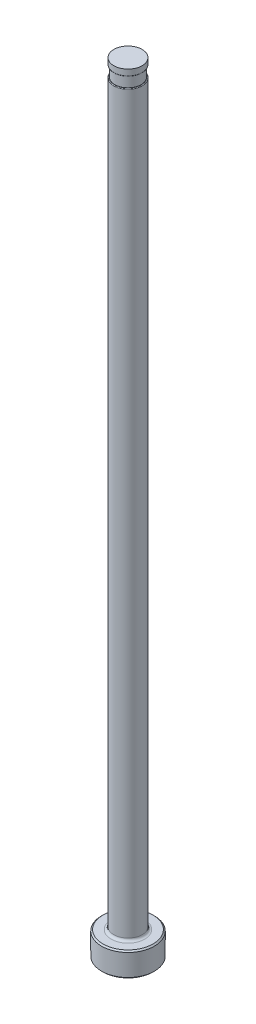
ISO-10303-21;
HEADER;
FILE_DESCRIPTION(('STEP AP214'),'2;1');
FILE_NAME('part.step','',(''),(''),'','','');
FILE_SCHEMA(('AUTOMOTIVE_DESIGN { 1 0 10303 214 1 1 1 1 }'));
ENDSEC;
DATA;
#1=APPLICATION_CONTEXT('core data for automotive mechanical design processes');
#2=APPLICATION_PROTOCOL_DEFINITION('international standard','automotive_design',2000,#1);
#3=PRODUCT_CONTEXT('',#1,'mechanical');
#4=PRODUCT('Part','Part','',(#3));
#5=PRODUCT_RELATED_PRODUCT_CATEGORY('part','',(#4));
#6=PRODUCT_DEFINITION_FORMATION('','',#4);
#7=PRODUCT_DEFINITION_CONTEXT('part definition',#1,'design');
#8=PRODUCT_DEFINITION('design','',#6,#7);
#9=PRODUCT_DEFINITION_SHAPE('','',#8);
#10=(LENGTH_UNIT() NAMED_UNIT(*) SI_UNIT(.MILLI.,.METRE.));
#11=(NAMED_UNIT(*) PLANE_ANGLE_UNIT() SI_UNIT($,.RADIAN.));
#12=(NAMED_UNIT(*) SI_UNIT($,.STERADIAN.) SOLID_ANGLE_UNIT());
#13=UNCERTAINTY_MEASURE_WITH_UNIT(LENGTH_MEASURE(1.E-05),#10,'distance_accuracy_value','');
#14=(GEOMETRIC_REPRESENTATION_CONTEXT(3) GLOBAL_UNCERTAINTY_ASSIGNED_CONTEXT((#13)) GLOBAL_UNIT_ASSIGNED_CONTEXT((#10,
#11,#12)) REPRESENTATION_CONTEXT('',''));
#15=CARTESIAN_POINT('',(0.,0.,0.));
#16=DIRECTION('',(0.,0.,1.));
#17=DIRECTION('',(1.,0.,0.));
#18=AXIS2_PLACEMENT_3D('',#15,#16,#17);
#19=CARTESIAN_POINT('',(-2.77748999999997,151.13,0.));
#20=DIRECTION('',(0.,1.,0.));
#21=DIRECTION('',(0.,0.,1.));
#22=AXIS2_PLACEMENT_3D('',#19,#20,#21);
#23=PLANE('',#22);
#24=CARTESIAN_POINT('',(0.,151.13,0.));
#25=DIRECTION('',(0.,1.,0.));
#26=DIRECTION('',(0.,0.,1.));
#27=AXIS2_PLACEMENT_3D('',#24,#25,#26);
#28=CIRCLE('',#27,2.63778999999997);
#29=CARTESIAN_POINT('',(0.,151.13,2.63778999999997));
#30=VERTEX_POINT('',#29);
#31=EDGE_CURVE('E11',#30,#30,#28,.F.);
#32=ORIENTED_EDGE('',*,*,#31,.T.);
#33=EDGE_LOOP('',(#32));
#34=FACE_BOUND('',#33,.T.);
#35=CARTESIAN_POINT('',(0.,151.13,0.));
#36=DIRECTION('',(0.,1.,0.));
#37=DIRECTION('',(0.,0.,1.));
#38=AXIS2_PLACEMENT_3D('',#35,#36,#37);
#39=CIRCLE('',#38,2.57428999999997);
#40=CARTESIAN_POINT('',(0.,151.13,2.57428999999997));
#41=VERTEX_POINT('',#40);
#42=EDGE_CURVE('E78',#41,#41,#39,.T.);
#43=ORIENTED_EDGE('',*,*,#42,.T.);
#44=EDGE_LOOP('',(#43));
#45=FACE_BOUND('',#44,.T.);
#46=ADVANCED_FACE('F36',(#34,#45),#23,.F.);
#47=CARTESIAN_POINT('',(0.,259.958771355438,0.));
#48=DIRECTION('',(0.,1.,0.));
#49=DIRECTION('',(0.,0.,1.));
#50=AXIS2_PLACEMENT_3D('',#47,#48,#49);
#51=CYLINDRICAL_SURFACE('',#50,2.77748999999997);
#52=DIRECTION('',(0.,1.,0.));
#53=VECTOR('',#52,1.);
#54=CARTESIAN_POINT('',(-2.57428999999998,259.958771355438,-1.04282390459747));
#55=LINE('',#54,#53);
#56=CARTESIAN_POINT('',(-2.57428999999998,148.971,-1.04282390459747));
#57=VERTEX_POINT('',#56);
#58=CARTESIAN_POINT('',(-2.57428999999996,86.614,-1.04282390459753));
#59=VERTEX_POINT('',#58);
#60=EDGE_CURVE('E73',#57,#59,#55,.F.);
#61=ORIENTED_EDGE('',*,*,#60,.F.);
#62=CARTESIAN_POINT('',(0.,148.971,0.));
#63=DIRECTION('',(0.,-1.,0.));
#64=DIRECTION('',(0.,0.,-1.));
#65=AXIS2_PLACEMENT_3D('',#62,#63,#64);
#66=CIRCLE('',#65,2.77748999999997);
#67=CARTESIAN_POINT('',(-2.57428999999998,148.971,1.04282390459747));
#68=VERTEX_POINT('',#67);
#69=EDGE_CURVE('E51',#57,#68,#66,.T.);
#70=ORIENTED_EDGE('',*,*,#69,.T.);
#71=DIRECTION('',(0.,1.,0.));
#72=VECTOR('',#71,1.);
#73=CARTESIAN_POINT('',(-2.57428999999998,259.958771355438,1.04282390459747));
#74=LINE('',#73,#72);
#75=CARTESIAN_POINT('',(-2.57428999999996,86.614,1.04282390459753));
#76=VERTEX_POINT('',#75);
#77=EDGE_CURVE('E84',#76,#68,#74,.T.);
#78=ORIENTED_EDGE('',*,*,#77,.F.);
#79=CARTESIAN_POINT('',(-2.57428999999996,86.614,-1.04282390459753));
#80=CARTESIAN_POINT('',(-2.57428787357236,86.5815852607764,-1.04282111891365));
#81=CARTESIAN_POINT('',(-2.57478701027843,86.5491850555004,-1.04159798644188));
#82=CARTESIAN_POINT('',(-2.57676382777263,86.4845964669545,-1.03670102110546));
#83=CARTESIAN_POINT('',(-2.57824163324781,86.4524081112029,-1.03302687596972));
#84=CARTESIAN_POINT('',(-2.58411032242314,86.356391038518,-1.01830472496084));
#85=CARTESIAN_POINT('',(-2.58993639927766,86.2931681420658,-1.00355696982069));
#86=CARTESIAN_POINT('',(-2.60484835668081,86.1701975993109,-0.964186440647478));
#87=CARTESIAN_POINT('',(-2.61393879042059,86.1104549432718,-0.939549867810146));
#88=CARTESIAN_POINT('',(-2.63439257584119,85.9964330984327,-0.880565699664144));
#89=CARTESIAN_POINT('',(-2.64575368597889,85.9421486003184,-0.846227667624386));
#90=CARTESIAN_POINT('',(-2.66906948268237,85.8423648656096,-0.769463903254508));
#91=CARTESIAN_POINT('',(-2.68099701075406,85.796654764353,-0.727304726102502));
#92=CARTESIAN_POINT('',(-2.70429977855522,85.7137106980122,-0.635186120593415));
#93=CARTESIAN_POINT('',(-2.71567511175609,85.676475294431,-0.585228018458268));
#94=CARTESIAN_POINT('',(-2.73569711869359,85.6140565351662,-0.482647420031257));
#95=CARTESIAN_POINT('',(-2.74447837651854,85.5882160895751,-0.430450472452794));
#96=CARTESIAN_POINT('',(-2.75929586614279,85.5457915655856,-0.322059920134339));
#97=CARTESIAN_POINT('',(-2.76533294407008,85.5292046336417,-0.265867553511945));
#98=CARTESIAN_POINT('',(-2.77376309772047,85.5062965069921,-0.153923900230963));
#99=CARTESIAN_POINT('',(-2.77631330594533,85.4995317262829,-0.0982747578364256));
#100=CARTESIAN_POINT('',(-2.77801884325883,85.4949917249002,0.0134385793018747));
#101=CARTESIAN_POINT('',(-2.77717458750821,85.497215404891,0.0695027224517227));
#102=CARTESIAN_POINT('',(-2.7722209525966,85.5104908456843,0.179520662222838));
#103=CARTESIAN_POINT('',(-2.76816343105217,85.5214024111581,0.233493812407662));
#104=CARTESIAN_POINT('',(-2.75726458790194,85.5516137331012,0.33873691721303));
#105=CARTESIAN_POINT('',(-2.7504233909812,85.5709131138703,0.390006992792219));
#106=CARTESIAN_POINT('',(-2.73459621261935,85.617579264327,0.488834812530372));
#107=CARTESIAN_POINT('',(-2.7255949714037,85.6450037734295,0.536362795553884));
#108=CARTESIAN_POINT('',(-2.70638807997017,85.7071227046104,0.626118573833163));
#109=CARTESIAN_POINT('',(-2.69618232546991,85.741817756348,0.668345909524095));
#110=CARTESIAN_POINT('',(-2.67522940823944,85.8187559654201,0.747895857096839));
#111=CARTESIAN_POINT('',(-2.66447542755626,85.8612077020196,0.785014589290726));
#112=CARTESIAN_POINT('',(-2.64380227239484,85.9516395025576,0.852053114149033));
#113=CARTESIAN_POINT('',(-2.63388340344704,85.9996215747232,0.881970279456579));
#114=CARTESIAN_POINT('',(-2.61524736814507,86.1028148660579,0.935839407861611));
#115=CARTESIAN_POINT('',(-2.60663744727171,86.1582867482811,0.959328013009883));
#116=CARTESIAN_POINT('',(-2.5921893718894,86.2724618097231,0.997711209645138));
#117=CARTESIAN_POINT('',(-2.58635078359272,86.3311644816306,1.01260714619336));
#118=CARTESIAN_POINT('',(-2.57955503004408,86.4275266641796,1.02975451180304));
#119=CARTESIAN_POINT('',(-2.57758531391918,86.4646676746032,1.03466198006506));
#120=CARTESIAN_POINT('',(-2.57495138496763,86.5392020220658,1.04119168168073));
#121=CARTESIAN_POINT('',(-2.57428434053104,86.5765946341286,1.04282104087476));
#122=CARTESIAN_POINT('',(-2.57428999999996,86.614,1.04282390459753));
#123=B_SPLINE_CURVE_WITH_KNOTS('',3,(#79,#80,#81,#82,#83,#84,#85,#86,#87,#88,#89,#90,#91,#92,
#93,#94,#95,#96,#97,#98,#99,#100,#101,#102,#103,#104,#105,#106,#107,#108,#109,#110,#111,#112,
#113,#114,#115,#116,#117,#118,#119,#120,#121,#122),.UNSPECIFIED.,.F.,.F.,(4,2,2,2,2,2,2,2,2,2,2,
2,2,2,2,2,2,2,2,2,2,4),(0.,0.0971880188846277,0.194388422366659,0.388960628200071,
0.583805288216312,0.778458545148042,0.967406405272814,1.1563221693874,1.33212671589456,
1.50787701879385,1.67541271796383,1.84292792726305,2.00779344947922,2.17265158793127,
2.33871056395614,2.5047839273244,2.67625192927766,2.84778239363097,3.02956415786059,
3.21131745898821,3.32371085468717,3.43585966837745),.UNSPECIFIED.);
#124=EDGE_CURVE('E81',#59,#76,#123,.T.);
#125=ORIENTED_EDGE('',*,*,#124,.F.);
#126=EDGE_LOOP('',(#61,#70,#78,#125));
#127=FACE_BOUND('',#126,.T.);
#128=CARTESIAN_POINT('',(0.,5.25779999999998,0.));
#129=DIRECTION('',(0.,1.,0.));
#130=DIRECTION('',(0.,0.,1.));
#131=AXIS2_PLACEMENT_3D('',#128,#129,#130);
#132=CIRCLE('',#131,2.77748999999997);
#133=CARTESIAN_POINT('',(0.,5.25779999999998,2.77748999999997));
#134=VERTEX_POINT('',#133);
#135=EDGE_CURVE('E116',#134,#134,#132,.T.);
#136=ORIENTED_EDGE('',*,*,#135,.T.);
#137=EDGE_LOOP('',(#136));
#138=FACE_BOUND('',#137,.T.);
#139=ADVANCED_FACE('F82',(#127,#138),#51,.T.);
#140=CARTESIAN_POINT('',(0.,0.,0.));
#141=DIRECTION('',(0.,-1.,0.));
#142=DIRECTION('',(0.,0.,-1.));
#143=AXIS2_PLACEMENT_3D('',#140,#141,#142);
#144=PLANE('',#143);
#145=CARTESIAN_POINT('',(0.,0.,0.));
#146=DIRECTION('',(0.,-1.,0.));
#147=DIRECTION('',(0.,0.,-1.));
#148=AXIS2_PLACEMENT_3D('',#145,#146,#147);
#149=CIRCLE('',#148,4.90220000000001);
#150=CARTESIAN_POINT('',(0.,0.,-4.90220000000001));
#151=VERTEX_POINT('',#150);
#152=EDGE_CURVE('E113',#151,#151,#149,.T.);
#153=ORIENTED_EDGE('',*,*,#152,.T.);
#154=EDGE_LOOP('',(#153));
#155=FACE_BOUND('',#154,.T.);
#156=ADVANCED_FACE('F192',(#155),#144,.T.);
#157=CARTESIAN_POINT('',(0.,259.958771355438,0.));
#158=DIRECTION('',(0.,1.,0.));
#159=DIRECTION('',(0.,0.,1.));
#160=AXIS2_PLACEMENT_3D('',#157,#158,#159);
#161=CYLINDRICAL_SURFACE('',#160,5.15619999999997);
#162=CARTESIAN_POINT('',(0.,4.49580000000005,0.));
#163=DIRECTION('',(0.,1.,0.));
#164=DIRECTION('',(0.,0.,1.));
#165=AXIS2_PLACEMENT_3D('',#162,#163,#164);
#166=CIRCLE('',#165,5.15619999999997);
#167=CARTESIAN_POINT('',(0.,4.49580000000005,5.15619999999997));
#168=VERTEX_POINT('',#167);
#169=EDGE_CURVE('E110',#168,#168,#166,.F.);
#170=ORIENTED_EDGE('',*,*,#169,.T.);
#171=EDGE_LOOP('',(#170));
#172=FACE_BOUND('',#171,.T.);
#173=CARTESIAN_POINT('',(0.,0.253999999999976,0.));
#174=DIRECTION('',(0.,-1.,0.));
#175=DIRECTION('',(0.,0.,-1.));
#176=AXIS2_PLACEMENT_3D('',#173,#174,#175);
#177=CIRCLE('',#176,5.15619999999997);
#178=CARTESIAN_POINT('',(0.,0.253999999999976,-5.15619999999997));
#179=VERTEX_POINT('',#178);
#180=EDGE_CURVE('E107',#179,#179,#177,.F.);
#181=ORIENTED_EDGE('',*,*,#180,.T.);
#182=EDGE_LOOP('',(#181));
#183=FACE_BOUND('',#182,.T.);
#184=ADVANCED_FACE('F195',(#172,#183),#161,.T.);
#185=CARTESIAN_POINT('',(-5.15619999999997,4.7498,0.));
#186=DIRECTION('',(0.,1.,0.));
#187=DIRECTION('',(0.,0.,1.));
#188=AXIS2_PLACEMENT_3D('',#185,#186,#187);
#189=PLANE('',#188);
#190=CARTESIAN_POINT('',(0.,4.7498,0.));
#191=DIRECTION('',(0.,1.,0.));
#192=DIRECTION('',(0.,0.,1.));
#193=AXIS2_PLACEMENT_3D('',#190,#191,#192);
#194=CIRCLE('',#193,3.28548999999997);
#195=CARTESIAN_POINT('',(0.,4.7498,3.28548999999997));
#196=VERTEX_POINT('',#195);
#197=EDGE_CURVE('E87',#196,#196,#194,.F.);
#198=ORIENTED_EDGE('',*,*,#197,.T.);
#199=EDGE_LOOP('',(#198));
#200=FACE_BOUND('',#199,.T.);
#201=CARTESIAN_POINT('',(0.,4.7498,0.));
#202=DIRECTION('',(0.,1.,0.));
#203=DIRECTION('',(0.,0.,1.));
#204=AXIS2_PLACEMENT_3D('',#201,#202,#203);
#205=CIRCLE('',#204,4.90220000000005);
#206=CARTESIAN_POINT('',(0.,4.7498,4.90220000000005));
#207=VERTEX_POINT('',#206);
#208=EDGE_CURVE('E104',#207,#207,#205,.T.);
#209=ORIENTED_EDGE('',*,*,#208,.T.);
#210=EDGE_LOOP('',(#209));
#211=FACE_BOUND('',#210,.T.);
#212=ADVANCED_FACE('F190',(#200,#211),#189,.T.);
#213=CARTESIAN_POINT('',(0.,4.74980000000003,0.));
#214=DIRECTION('',(0.,-1.,0.));
#215=DIRECTION('',(0.,0.,-1.));
#216=AXIS2_PLACEMENT_3D('',#213,#214,#215);
#217=CONICAL_SURFACE('',#216,4.90220000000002,0.785398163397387);
#218=ORIENTED_EDGE('',*,*,#169,.F.);
#219=EDGE_LOOP('',(#218));
#220=FACE_BOUND('',#219,.T.);
#221=ORIENTED_EDGE('',*,*,#208,.F.);
#222=EDGE_LOOP('',(#221));
#223=FACE_BOUND('',#222,.T.);
#224=ADVANCED_FACE('F186',(#220,#223),#217,.T.);
#225=CARTESIAN_POINT('',(0.,0.253999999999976,0.));
#226=DIRECTION('',(0.,1.,0.));
#227=DIRECTION('',(0.,0.,1.));
#228=AXIS2_PLACEMENT_3D('',#225,#226,#227);
#229=CONICAL_SURFACE('',#228,5.15619999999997,0.785398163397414);
#230=ORIENTED_EDGE('',*,*,#152,.F.);
#231=EDGE_LOOP('',(#230));
#232=FACE_BOUND('',#231,.T.);
#233=ORIENTED_EDGE('',*,*,#180,.F.);
#234=EDGE_LOOP('',(#233));
#235=FACE_BOUND('',#234,.T.);
#236=ADVANCED_FACE('F182',(#232,#235),#229,.T.);
#237=CARTESIAN_POINT('',(0.,5.25779999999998,0.));
#238=DIRECTION('',(0.,1.,0.));
#239=DIRECTION('',(0.,0.,1.));
#240=AXIS2_PLACEMENT_3D('',#237,#238,#239);
#241=TOROIDAL_SURFACE('',#240,3.28548999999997,0.508);
#242=ORIENTED_EDGE('',*,*,#197,.F.);
#243=EDGE_LOOP('',(#242));
#244=FACE_BOUND('',#243,.T.);
#245=ORIENTED_EDGE('',*,*,#135,.F.);
#246=EDGE_LOOP('',(#245));
#247=FACE_BOUND('',#246,.T.);
#248=ADVANCED_FACE('F147',(#244,#247),#241,.F.);
#249=CARTESIAN_POINT('',(-2.77748999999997,149.098,0.));
#250=DIRECTION('',(0.,-1.,0.));
#251=DIRECTION('',(0.,0.,-1.));
#252=AXIS2_PLACEMENT_3D('',#249,#250,#251);
#253=PLANE('',#252);
#254=DIRECTION('',(0.,0.,1.));
#255=VECTOR('',#254,1.);
#256=CARTESIAN_POINT('',(-2.57428999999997,149.098,0.));
#257=LINE('',#256,#255);
#258=CARTESIAN_POINT('',(-2.57428999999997,149.098,0.));
#259=VERTEX_POINT('',#258);
#260=CARTESIAN_POINT('',(-2.57428999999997,149.098,0.630974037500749));
#261=VERTEX_POINT('',#260);
#262=EDGE_CURVE('E90',#259,#261,#257,.T.);
#263=ORIENTED_EDGE('',*,*,#262,.T.);
#264=CARTESIAN_POINT('',(0.,149.098,0.));
#265=DIRECTION('',(0.,-1.,0.));
#266=DIRECTION('',(0.,0.,-1.));
#267=AXIS2_PLACEMENT_3D('',#264,#265,#266);
#268=CIRCLE('',#267,2.65048999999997);
#269=CARTESIAN_POINT('',(-2.57428999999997,149.098,-0.630974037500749));
#270=VERTEX_POINT('',#269);
#271=EDGE_CURVE('E86',#261,#270,#268,.F.);
#272=ORIENTED_EDGE('',*,*,#271,.T.);
#273=EDGE_CURVE('E79',#270,#259,#257,.T.);
#274=ORIENTED_EDGE('',*,*,#273,.T.);
#275=CARTESIAN_POINT('',(0.,149.098,0.));
#276=DIRECTION('',(0.,1.,0.));
#277=DIRECTION('',(0.,0.,1.));
#278=AXIS2_PLACEMENT_3D('',#275,#276,#277);
#279=CIRCLE('',#278,2.57428999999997);
#280=EDGE_CURVE('E101',#259,#259,#279,.T.);
#281=ORIENTED_EDGE('',*,*,#280,.F.);
#282=EDGE_LOOP('',(#263,#272,#274,#281));
#283=FACE_BOUND('',#282,.T.);
#284=ADVANCED_FACE('F144',(#283),#253,.F.);
#285=CARTESIAN_POINT('',(0.,153.448281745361,0.));
#286=DIRECTION('',(0.,1.,0.));
#287=DIRECTION('',(0.,0.,1.));
#288=AXIS2_PLACEMENT_3D('',#285,#286,#287);
#289=CYLINDRICAL_SURFACE('',#288,2.57428999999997);
#290=ORIENTED_EDGE('',*,*,#42,.F.);
#291=EDGE_LOOP('',(#290));
#292=FACE_BOUND('',#291,.T.);
#293=ORIENTED_EDGE('',*,*,#280,.T.);
#294=EDGE_LOOP('',(#293));
#295=FACE_BOUND('',#294,.T.);
#296=ADVANCED_FACE('F141',(#292,#295),#289,.T.);
#297=CARTESIAN_POINT('',(-2.57428999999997,150.114,-5.15619999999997));
#298=DIRECTION('',(1.,0.,0.));
#299=DIRECTION('',(0.,1.,0.));
#300=AXIS2_PLACEMENT_3D('',#297,#298,#299);
#301=PLANE('',#300);
#302=ORIENTED_EDGE('',*,*,#273,.F.);
#303=CARTESIAN_POINT('',(-2.57428999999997,149.098,-0.630974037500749));
#304=CARTESIAN_POINT('',(-2.57428999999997,149.097988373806,-0.652186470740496));
#305=CARTESIAN_POINT('',(-2.57428999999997,149.097697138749,-0.673409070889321));
#306=CARTESIAN_POINT('',(-2.57428999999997,149.096309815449,-0.715909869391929));
#307=CARTESIAN_POINT('',(-2.57428999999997,149.095210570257,-0.73718795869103));
#308=CARTESIAN_POINT('',(-2.57428999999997,149.091955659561,-0.779696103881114));
#309=CARTESIAN_POINT('',(-2.57428999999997,149.089798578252,-0.800926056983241));
#310=CARTESIAN_POINT('',(-2.57428999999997,149.084053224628,-0.8431716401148));
#311=CARTESIAN_POINT('',(-2.57428999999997,149.080467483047,-0.864187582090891));
#312=CARTESIAN_POINT('',(-2.57428999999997,149.07367465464,-0.894737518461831));
#313=CARTESIAN_POINT('',(-2.57428999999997,149.071275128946,-0.904450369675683));
#314=CARTESIAN_POINT('',(-2.57428999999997,149.065899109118,-0.923745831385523));
#315=CARTESIAN_POINT('',(-2.57428999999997,149.062921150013,-0.933328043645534));
#316=CARTESIAN_POINT('',(-2.57428999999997,149.055733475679,-0.95367532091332));
#317=CARTESIAN_POINT('',(-2.57428999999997,149.051405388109,-0.964399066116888));
#318=CARTESIAN_POINT('',(-2.57428999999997,149.041429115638,-0.985202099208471));
#319=CARTESIAN_POINT('',(-2.57428999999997,149.035787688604,-0.995284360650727));
#320=CARTESIAN_POINT('',(-2.57428999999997,149.026621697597,-1.00826014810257));
#321=CARTESIAN_POINT('',(-2.57428999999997,149.023943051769,-1.0117461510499));
#322=CARTESIAN_POINT('',(-2.57428999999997,149.018228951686,-1.01843326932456));
#323=CARTESIAN_POINT('',(-2.57428999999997,149.015192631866,-1.02163365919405));
#324=CARTESIAN_POINT('',(-2.57428999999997,149.008665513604,-1.02764631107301));
#325=CARTESIAN_POINT('',(-2.57428999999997,149.005168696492,-1.03045218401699));
#326=CARTESIAN_POINT('',(-2.57428999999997,148.997739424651,-1.03537629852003));
#327=CARTESIAN_POINT('',(-2.57428999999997,148.993810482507,-1.03749960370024));
#328=CARTESIAN_POINT('',(-2.57428999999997,148.986740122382,-1.04030637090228));
#329=CARTESIAN_POINT('',(-2.57428999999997,148.98369508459,-1.04122798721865));
#330=CARTESIAN_POINT('',(-2.57428999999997,148.977439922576,-1.04249667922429));
#331=CARTESIAN_POINT('',(-2.57428999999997,148.974227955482,-1.04283449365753));
#332=CARTESIAN_POINT('',(-2.57428999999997,148.971,-1.04282390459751));
#333=B_SPLINE_CURVE_WITH_KNOTS('',3,(#303,#304,#305,#306,#307,#308,#309,#310,#311,#312,#313,
#314,#315,#316,#317,#318,#319,#320,#321,#322,#323,#324,#325,#326,#327,#328,#329,#330,#331,#332),
.UNSPECIFIED.,.F.,.F.,(4,2,2,2,2,2,2,2,2,2,2,2,2,2,4),(0.,0.0636515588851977,0.1275531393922,
0.19154048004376,0.255414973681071,0.285417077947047,0.315496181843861,0.350142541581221,
0.384614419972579,0.397785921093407,0.410989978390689,0.424387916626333,0.437684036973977,
0.447175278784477,0.456815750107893),.UNSPECIFIED.);
#334=EDGE_CURVE('E59',#270,#57,#333,.T.);
#335=ORIENTED_EDGE('',*,*,#334,.T.);
#336=ORIENTED_EDGE('',*,*,#60,.T.);
#337=DIRECTION('',(0.,0.,1.));
#338=VECTOR('',#337,1.);
#339=CARTESIAN_POINT('',(-2.57428999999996,86.614,-5.15619999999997));
#340=LINE('',#339,#338);
#341=EDGE_CURVE('E77',#59,#76,#340,.T.);
#342=ORIENTED_EDGE('',*,*,#341,.T.);
#343=ORIENTED_EDGE('',*,*,#77,.T.);
#344=CARTESIAN_POINT('',(-2.57428999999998,148.971,1.04282390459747));
#345=CARTESIAN_POINT('',(-2.57428999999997,148.973997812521,1.04283236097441));
#346=CARTESIAN_POINT('',(-2.57428999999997,148.976984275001,1.04254163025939));
#347=CARTESIAN_POINT('',(-2.57428999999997,148.98282304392,1.04144104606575));
#348=CARTESIAN_POINT('',(-2.57428999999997,148.985676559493,1.04063771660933));
#349=CARTESIAN_POINT('',(-2.57428999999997,148.991880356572,1.03834208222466));
#350=CARTESIAN_POINT('',(-2.57428999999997,148.995185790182,1.0367307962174));
#351=CARTESIAN_POINT('',(-2.57428999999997,149.001505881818,1.03299596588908));
#352=CARTESIAN_POINT('',(-2.57428999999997,149.004518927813,1.03086978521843));
#353=CARTESIAN_POINT('',(-2.57428999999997,149.012062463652,1.02479237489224));
#354=CARTESIAN_POINT('',(-2.57428999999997,149.016345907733,1.02053793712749));
#355=CARTESIAN_POINT('',(-2.57428999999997,149.024251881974,1.01146538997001));
#356=CARTESIAN_POINT('',(-2.57428999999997,149.027873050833,1.00664615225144));
#357=CARTESIAN_POINT('',(-2.57428999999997,149.038266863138,0.991217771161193));
#358=CARTESIAN_POINT('',(-2.57428999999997,149.044166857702,0.980028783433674));
#359=CARTESIAN_POINT('',(-2.57428999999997,149.054501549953,0.957006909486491));
#360=CARTESIAN_POINT('',(-2.57428999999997,149.058931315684,0.945172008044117));
#361=CARTESIAN_POINT('',(-2.57428999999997,149.069366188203,0.913140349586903));
#362=CARTESIAN_POINT('',(-2.57428999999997,149.074443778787,0.89264434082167));
#363=CARTESIAN_POINT('',(-2.57428999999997,149.082753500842,0.851271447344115));
#364=CARTESIAN_POINT('',(-2.57428999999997,149.085981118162,0.830393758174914));
#365=CARTESIAN_POINT('',(-2.57428999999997,149.093717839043,0.767434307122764));
#366=CARTESIAN_POINT('',(-2.57428999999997,149.096259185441,0.725112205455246));
#367=CARTESIAN_POINT('',(-2.57428999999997,149.097575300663,0.674152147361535));
#368=CARTESIAN_POINT('',(-2.57428999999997,149.097738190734,0.665497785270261));
#369=CARTESIAN_POINT('',(-2.57428999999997,149.097950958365,0.648220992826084));
#370=CARTESIAN_POINT('',(-2.57428999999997,149.09800126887,0.639598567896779));
#371=CARTESIAN_POINT('',(-2.57428999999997,149.098,0.63097403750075));
#372=B_SPLINE_CURVE_WITH_KNOTS('',3,(#344,#345,#346,#347,#348,#349,#350,#351,#352,#353,#354,
#355,#356,#357,#358,#359,#360,#361,#362,#363,#364,#365,#366,#367,#368,#369,#370,#371),
.UNSPECIFIED.,.F.,.F.,(4,2,2,2,2,2,2,2,2,2,2,2,2,4),(0.,0.00896107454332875,0.017810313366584,
0.0287804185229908,0.0398079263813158,0.0578172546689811,0.0758631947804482,0.113599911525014,
0.151461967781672,0.214643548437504,0.277978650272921,0.404912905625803,0.430882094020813,
0.456751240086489),.UNSPECIFIED.);
#373=EDGE_CURVE('E172',#68,#261,#372,.T.);
#374=ORIENTED_EDGE('',*,*,#373,.T.);
#375=ORIENTED_EDGE('',*,*,#262,.F.);
#376=EDGE_LOOP('',(#302,#335,#336,#342,#343,#374,#375));
#377=FACE_BOUND('',#376,.T.);
#378=ADVANCED_FACE('F75',(#377),#301,.F.);
#379=CARTESIAN_POINT('',(-5.74928999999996,86.614,-5.15619999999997));
#380=DIRECTION('',(0.,0.,1.));
#381=DIRECTION('',(1.,0.,0.));
#382=AXIS2_PLACEMENT_3D('',#379,#380,#381);
#383=CYLINDRICAL_SURFACE('',#382,3.175);
#384=ORIENTED_EDGE('',*,*,#341,.F.);
#385=ORIENTED_EDGE('',*,*,#124,.T.);
#386=EDGE_LOOP('',(#384,#385));
#387=FACE_BOUND('',#386,.T.);
#388=ADVANCED_FACE('F89',(#387),#383,.F.);
#389=CARTESIAN_POINT('',(0.,152.687735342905,0.));
#390=DIRECTION('',(0.,1.,0.));
#391=DIRECTION('',(0.,0.,1.));
#392=AXIS2_PLACEMENT_3D('',#389,#390,#391);
#393=CYLINDRICAL_SURFACE('',#392,2.76478999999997);
#394=CARTESIAN_POINT('',(0.,151.257,0.));
#395=DIRECTION('',(0.,1.,0.));
#396=DIRECTION('',(0.,0.,1.));
#397=AXIS2_PLACEMENT_3D('',#394,#395,#396);
#398=CIRCLE('',#397,2.76478999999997);
#399=CARTESIAN_POINT('',(0.,151.257,2.76478999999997));
#400=VERTEX_POINT('',#399);
#401=EDGE_CURVE('E44',#400,#400,#398,.T.);
#402=ORIENTED_EDGE('',*,*,#401,.T.);
#403=EDGE_LOOP('',(#402));
#404=FACE_BOUND('',#403,.T.);
#405=CARTESIAN_POINT('',(0.,152.4,0.));
#406=DIRECTION('',(0.,1.,0.));
#407=DIRECTION('',(0.,0.,1.));
#408=AXIS2_PLACEMENT_3D('',#405,#406,#407);
#409=CIRCLE('',#408,2.76478999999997);
#410=CARTESIAN_POINT('',(0.,152.4,2.76478999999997));
#411=VERTEX_POINT('',#410);
#412=EDGE_CURVE('E91',#411,#411,#409,.T.);
#413=ORIENTED_EDGE('',*,*,#412,.F.);
#414=EDGE_LOOP('',(#413));
#415=FACE_BOUND('',#414,.T.);
#416=ADVANCED_FACE('F135',(#404,#415),#393,.T.);
#417=CARTESIAN_POINT('',(-2.77748999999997,152.4,0.));
#418=DIRECTION('',(0.,1.,0.));
#419=DIRECTION('',(0.,0.,1.));
#420=AXIS2_PLACEMENT_3D('',#417,#418,#419);
#421=PLANE('',#420);
#422=ORIENTED_EDGE('',*,*,#412,.T.);
#423=EDGE_LOOP('',(#422));
#424=FACE_BOUND('',#423,.T.);
#425=ADVANCED_FACE('F149',(#424),#421,.T.);
#426=CARTESIAN_POINT('',(0.,148.971,0.));
#427=DIRECTION('',(0.,-1.,0.));
#428=DIRECTION('',(0.,0.,-1.));
#429=AXIS2_PLACEMENT_3D('',#426,#427,#428);
#430=TOROIDAL_SURFACE('',#429,2.65048999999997,0.127);
#431=ORIENTED_EDGE('',*,*,#373,.F.);
#432=ORIENTED_EDGE('',*,*,#69,.F.);
#433=ORIENTED_EDGE('',*,*,#334,.F.);
#434=ORIENTED_EDGE('',*,*,#271,.F.);
#435=EDGE_LOOP('',(#431,#432,#433,#434));
#436=FACE_BOUND('',#435,.T.);
#437=ADVANCED_FACE('F151',(#436),#430,.T.);
#438=CARTESIAN_POINT('',(0.,151.257,0.));
#439=DIRECTION('',(0.,1.,0.));
#440=DIRECTION('',(0.,0.,1.));
#441=AXIS2_PLACEMENT_3D('',#438,#439,#440);
#442=TOROIDAL_SURFACE('',#441,2.63778999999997,0.127);
#443=ORIENTED_EDGE('',*,*,#31,.F.);
#444=EDGE_LOOP('',(#443));
#445=FACE_BOUND('',#444,.T.);
#446=ORIENTED_EDGE('',*,*,#401,.F.);
#447=EDGE_LOOP('',(#446));
#448=FACE_BOUND('',#447,.T.);
#449=ADVANCED_FACE('F38',(#445,#448),#442,.T.);
#450=CLOSED_SHELL('',(#46,#139,#156,#184,#212,#224,#236,#248,#284,#296,#378,#388,#416,#425,#437,#449));
#451=MANIFOLD_SOLID_BREP('B2',#450);
#452=ADVANCED_BREP_SHAPE_REPRESENTATION('',(#18,#451),#14);
#453=SHAPE_DEFINITION_REPRESENTATION(#9,#452);
ENDSEC;
END-ISO-10303-21;
